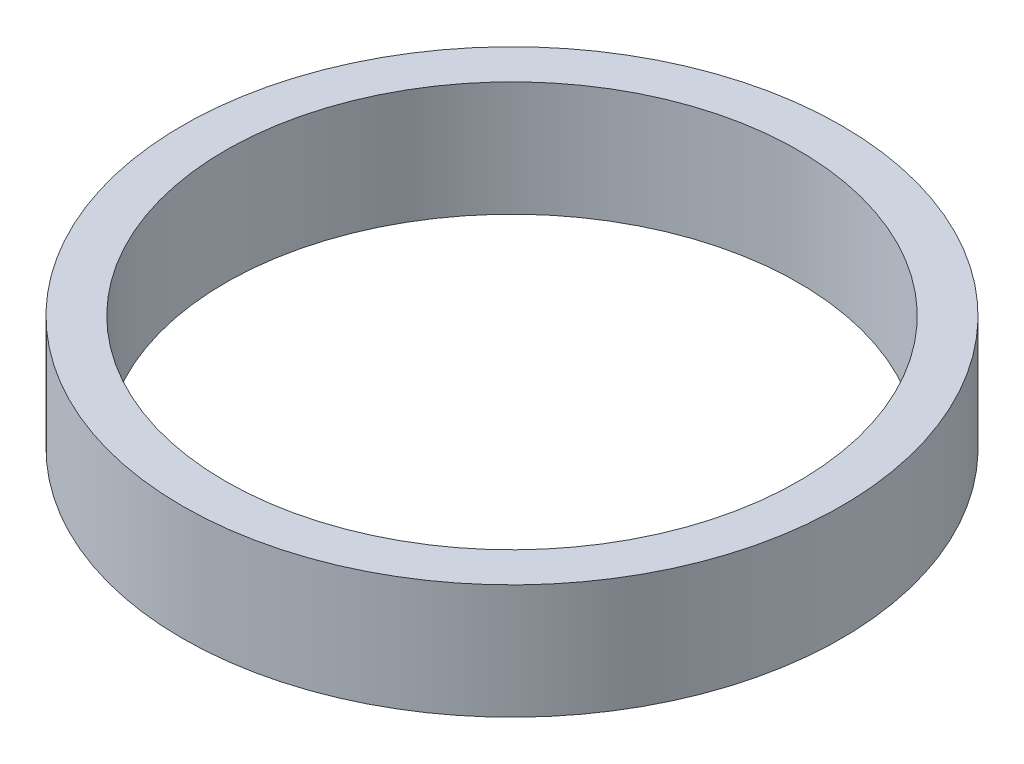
from build123d import *

# Parameters (mm, degrees)
SKETCH1_R           = 11.5
SKETCH1_R_2         = 10
BOSS_EXTRUDE1_DEPTH = 4


with BuildPart() as part:
    # Sketch1 → Boss-Extrude1 (new body)
    with BuildSketch(Plane(origin=(0, 0, 0), x_dir=(1, 0, 0), z_dir=(0, 1, 0))):
        with Locations(Location((0, 0, 0), (0, 0, 270))):
            Circle(SKETCH1_R)
        with Locations(Location((0, 0, 0), (0, 0, 270))):
            Circle(SKETCH1_R_2, mode=Mode.SUBTRACT)
    extrude(amount=BOSS_EXTRUDE1_DEPTH)


solid = part.part
